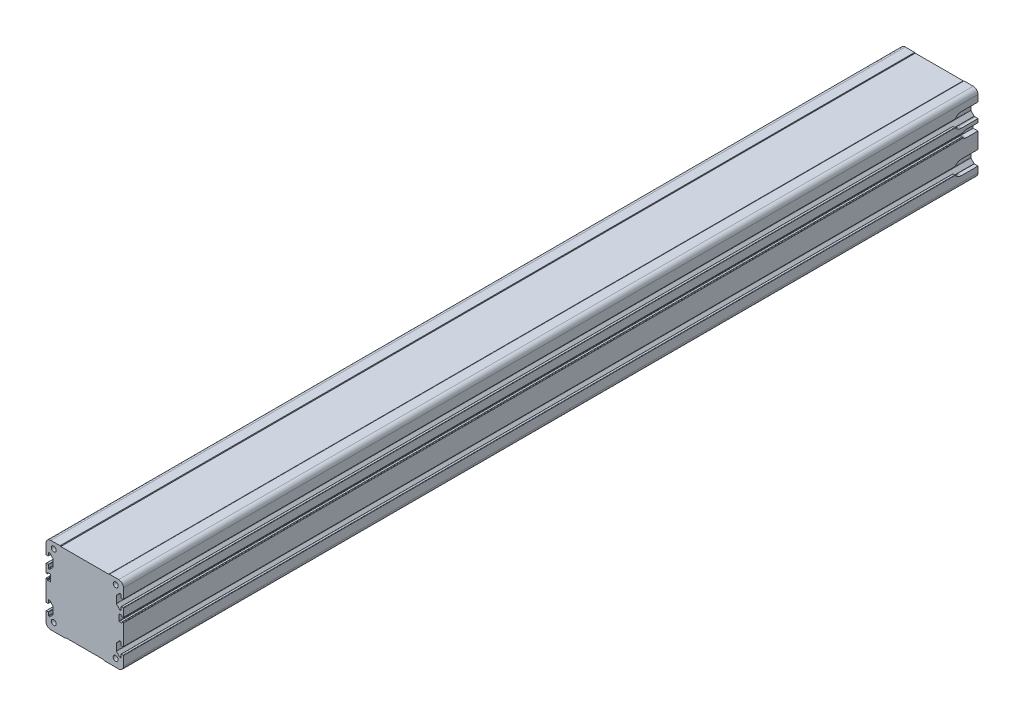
from build123d import *

# Parameters (mm, degrees)
EXTRUDE_1_DEPTH     = 717
CUT_EXTRUDE_1_DEPTH = 3
CUT_EXTRUDE_2_DEPTH = 4
HOLE_WIZARD_M5_1_D  = 4.2


with BuildPart() as part:
    # Sketch 1 → Extrude 1 (new body)
    with BuildSketch(Plane.XY):
        with BuildLine():
            Line((-20.255104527, 64.269974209), (-20.524892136, 64.430021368))
            ThreePointArc((-20.524892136, 64.430021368), (-20.647733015, 64.482185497), (-20.779996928, 64.499996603))
            Line((-20.779996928, 64.499996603), (-28.499994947, 64.500004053))
            ThreePointArc((-28.499994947, 64.500004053), (-31.328424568, 63.328432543), (-32.499998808, 60.500004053))
            Line((-32.499998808, 60.500004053), (-32.499998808, 52.299997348))
            ThreePointArc((-32.499998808, 52.299997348), (-32.412130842, 52.087865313), (-32.199998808, 51.999997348))
            Line((-32.199998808, 51.999997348), (-30.79999848, 51.999997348))
            ThreePointArc((-30.79999848, 51.999997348), (-30.587866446, 52.087865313), (-30.49999848, 52.299997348))
            Line((-30.49999848, 52.299997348), (-30.49999848, 54.700007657))
            ThreePointArc((-30.49999848, 54.700007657), (-30.412129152, 54.912141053), (-30.199994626, 55.000007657))
            Line((-30.199994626, 55.000007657), (-29.437900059, 54.999997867))
            ThreePointArc((-29.437900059, 54.999997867), (-29.318491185, 54.975207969), (-29.218815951, 54.904938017))
            Line((-29.218815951, 54.904938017), (-26.634851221, 52.142592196))
            ThreePointArc((-26.634851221, 52.142592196), (-26.534931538, 51.984637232), (-26.499997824, 51.801025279))
            Line((-26.499997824, 51.801025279), (-26.499997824, 46.198974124))
            ThreePointArc((-26.499997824, 46.198974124), (-26.534931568, 46.015362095), (-26.634851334, 45.857407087))
            Line((-26.634851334, 45.857407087), (-29.218823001, 43.095055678))
            ThreePointArc((-29.218823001, 43.095055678), (-29.318501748, 43.024784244), (-29.437914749, 42.9999959))
            Line((-29.437914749, 42.9999959), (-30.200002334, 43.00000569))
            ThreePointArc((-30.200002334, 43.00000569), (-30.412131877, 43.087875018), (-30.49999848, 43.30000569))
            Line((-30.49999848, 43.30000569), (-30.49999848, 45.700000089))
            ThreePointArc((-30.49999848, 45.700000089), (-30.587866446, 45.912132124), (-30.79999848, 46.000000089))
            Line((-30.79999848, 46.000000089), (-32.199998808, 46.000000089))
            ThreePointArc((-32.199998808, 46.000000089), (-32.412130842, 45.912132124), (-32.499998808, 45.700000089))
            Line((-32.499998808, 45.700000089), (-32.499998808, 39.043954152))
            ThreePointArc((-32.499998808, 39.043954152), (-32.412130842, 38.831822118), (-32.199998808, 38.743954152))
            Line((-32.199998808, 38.743954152), (-31.499997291, 38.743954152))
            ThreePointArc((-31.499997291, 38.743954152), (-31.287865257, 38.831822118), (-31.199997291, 39.043954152))
            Line((-31.199997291, 39.043954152), (-31.199997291, 39.543954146))
            ThreePointArc((-31.199997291, 39.543954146), (-31.112129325, 39.75608618), (-30.899997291, 39.843954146))
            Line((-30.899997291, 39.843954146), (-28.899997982, 39.843954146))
            ThreePointArc((-28.899997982, 39.843954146), (-28.687865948, 39.75608618), (-28.599997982, 39.543954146))
            Line((-28.599997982, 39.543954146), (-28.599997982, 34.443954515))
            ThreePointArc((-28.599997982, 34.443954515), (-28.687865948, 34.231822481), (-28.899997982, 34.143954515))
            Line((-28.899997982, 34.143954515), (-30.899997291, 34.143954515))
            ThreePointArc((-30.899997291, 34.143954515), (-31.112129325, 34.231822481), (-31.199997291, 34.443954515))
            Line((-31.199997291, 34.443954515), (-31.199997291, 34.943954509))
            ThreePointArc((-31.199997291, 34.943954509), (-31.287865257, 35.156086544), (-31.499997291, 35.243954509))
            Line((-31.499997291, 35.243954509), (-32.199998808, 35.243954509))
            ThreePointArc((-32.199998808, 35.243954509), (-32.412130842, 35.156086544), (-32.499998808, 34.94395451))
            Line((-32.499998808, 34.94395451), (-32.499998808, 17.800000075))
            ThreePointArc((-32.499998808, 17.800000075), (-32.412130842, 17.58786804), (-32.199998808, 17.500000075))
            Line((-32.199998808, 17.500000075), (-30.800000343, 17.500000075))
            ThreePointArc((-30.800000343, 17.500000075), (-30.587868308, 17.58786804), (-30.500000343, 17.800000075))
            Line((-30.500000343, 17.800000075), (-30.500000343, 20.199998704))
            ThreePointArc((-30.500000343, 20.199998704), (-30.412132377, 20.412130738), (-30.200000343, 20.499998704))
            Line((-30.200000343, 20.499998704), (-29.437907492, 20.499998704))
            ThreePointArc((-29.437907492, 20.499998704), (-29.318496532, 20.475209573), (-29.218819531, 20.404938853))
            Line((-29.218819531, 20.404938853), (-26.634853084, 17.642591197))
            ThreePointArc((-26.634853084, 17.642591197), (-26.534933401, 17.484636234), (-26.499999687, 17.301024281))
            Line((-26.499999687, 17.301024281), (-26.499999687, 11.698975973))
            ThreePointArc((-26.499999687, 11.698975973), (-26.534933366, 11.515364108), (-26.634852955, 11.357409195))
            Line((-26.634852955, 11.357409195), (-29.218819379, 8.595059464))
            ThreePointArc((-29.218819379, 8.595059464), (-29.318496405, 8.524788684), (-29.437907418, 8.499999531))
            Line((-29.437907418, 8.499999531), (-30.200000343, 8.499999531))
            ThreePointArc((-30.200000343, 8.499999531), (-30.412132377, 8.587867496), (-30.500000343, 8.799999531))
            Line((-30.500000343, 8.799999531), (-30.500000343, 11.200000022))
            ThreePointArc((-30.500000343, 11.200000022), (-30.587868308, 11.412132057), (-30.800000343, 11.500000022))
            Line((-30.800000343, 11.500000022), (-32.199998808, 11.500000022))
            ThreePointArc((-32.199998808, 11.500000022), (-32.412130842, 11.412132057), (-32.499998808, 11.200000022))
            Line((-32.499998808, 11.200000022), (-32.499998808, 3.500000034))
            ThreePointArc((-32.499998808, 3.500000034), (-31.328425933, 0.67157291), (-28.499998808, -0.499999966))
            Line((-28.499998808, -0.499999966), (-16.482218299, -0.499999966))
            ThreePointArc((-16.482218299, -0.499999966), (-16.255782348, -0.474026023), (-16.041109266, -0.397453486))
            Line((-16.041109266, -0.397453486), (-15.441109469, -0.10254648))
            ThreePointArc((-15.441109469, -0.10254648), (-15.226436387, -0.025973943), (-15.000000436, 0))
            Line((-15.000000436, 0), (15.000000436, 0))
            ThreePointArc((15.000000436, 0), (15.226436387, -0.025973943), (15.441109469, -0.10254648))
            Line((15.441109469, -0.10254648), (16.041109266, -0.397453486))
            ThreePointArc((16.041109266, -0.397453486), (16.255782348, -0.474026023), (16.482218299, -0.499999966))
            Line((16.482218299, -0.499999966), (28.499998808, -0.499999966))
            ThreePointArc((28.499998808, -0.499999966), (31.328425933, 0.67157291), (32.499998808, 3.500000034))
            Line((32.499998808, 3.500000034), (32.499998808, 11.200000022))
            ThreePointArc((32.499998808, 11.200000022), (32.412130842, 11.412132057), (32.199998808, 11.500000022))
            Line((32.199998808, 11.500000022), (30.800000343, 11.500000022))
            ThreePointArc((30.800000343, 11.500000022), (30.587868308, 11.412132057), (30.500000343, 11.200000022))
            Line((30.500000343, 11.200000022), (30.500000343, 8.799999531))
            ThreePointArc((30.500000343, 8.799999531), (30.412132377, 8.587867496), (30.200000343, 8.499999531))
            Line((30.200000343, 8.499999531), (29.437907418, 8.499999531))
            ThreePointArc((29.437907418, 8.499999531), (29.318496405, 8.524788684), (29.218819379, 8.595059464))
            Line((29.218819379, 8.595059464), (26.634852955, 11.357409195))
            ThreePointArc((26.634852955, 11.357409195), (26.534933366, 11.515364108), (26.499999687, 11.698975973))
            Line((26.499999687, 11.698975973), (26.499999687, 17.301024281))
            ThreePointArc((26.499999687, 17.301024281), (26.534933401, 17.484636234), (26.634853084, 17.642591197))
            Line((26.634853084, 17.642591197), (29.218819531, 20.404938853))
            ThreePointArc((29.218819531, 20.404938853), (29.318496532, 20.475209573), (29.437907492, 20.499998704))
            Line((29.437907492, 20.499998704), (30.200000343, 20.499998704))
            ThreePointArc((30.200000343, 20.499998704), (30.412132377, 20.412130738), (30.500000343, 20.199998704))
            Line((30.500000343, 20.199998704), (30.500000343, 17.800000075))
            ThreePointArc((30.500000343, 17.800000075), (30.587868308, 17.58786804), (30.800000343, 17.500000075))
            Line((30.800000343, 17.500000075), (32.199998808, 17.500000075))
            ThreePointArc((32.199998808, 17.500000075), (32.412130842, 17.58786804), (32.499998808, 17.800000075))
            Line((32.499998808, 17.800000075), (32.499998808, 34.943954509))
            ThreePointArc((32.499998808, 34.943954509), (32.412130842, 35.156086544), (32.199998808, 35.243954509))
            Line((32.199998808, 35.243954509), (31.499997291, 35.243954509))
            ThreePointArc((31.499997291, 35.243954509), (31.287865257, 35.156086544), (31.199997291, 34.94395451))
            Line((31.199997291, 34.94395451), (31.199997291, 34.443954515))
            ThreePointArc((31.199997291, 34.443954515), (31.112129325, 34.231822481), (30.899997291, 34.143954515))
            Line((30.899997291, 34.143954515), (28.899997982, 34.143954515))
            ThreePointArc((28.899997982, 34.143954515), (28.687865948, 34.231822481), (28.599997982, 34.443954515))
            Line((28.599997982, 34.443954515), (28.599997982, 39.543954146))
            ThreePointArc((28.599997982, 39.543954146), (28.687865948, 39.75608618), (28.899997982, 39.843954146))
            Line((28.899997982, 39.843954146), (30.899997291, 39.843954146))
            ThreePointArc((30.899997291, 39.843954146), (31.112129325, 39.75608618), (31.199997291, 39.543954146))
            Line((31.199997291, 39.543954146), (31.199997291, 39.043954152))
            ThreePointArc((31.199997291, 39.043954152), (31.287865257, 38.831822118), (31.499997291, 38.743954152))
            Line((31.499997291, 38.743954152), (32.199998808, 38.743954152))
            ThreePointArc((32.199998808, 38.743954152), (32.412130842, 38.831822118), (32.499998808, 39.043954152))
            Line((32.499998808, 39.043954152), (32.499998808, 45.700000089))
            ThreePointArc((32.499998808, 45.700000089), (32.412130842, 45.912132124), (32.199998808, 46.000000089))
            Line((32.199998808, 46.000000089), (30.79999848, 46.000000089))
            ThreePointArc((30.79999848, 46.000000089), (30.587866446, 45.912132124), (30.49999848, 45.700000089))
            Line((30.49999848, 45.700000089), (30.49999848, 43.30000569))
            ThreePointArc((30.49999848, 43.30000569), (30.412131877, 43.087875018), (30.200002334, 43.00000569))
            Line((30.200002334, 43.00000569), (29.437914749, 42.9999959))
            ThreePointArc((29.437914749, 42.9999959), (29.318501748, 43.024784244), (29.218823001, 43.095055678))
            Line((29.218823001, 43.095055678), (26.634851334, 45.857407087))
            ThreePointArc((26.634851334, 45.857407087), (26.534931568, 46.015362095), (26.499997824, 46.198974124))
            Line((26.499997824, 46.198974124), (26.499997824, 51.801025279))
            ThreePointArc((26.499997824, 51.801025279), (26.534931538, 51.984637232), (26.634851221, 52.142592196))
            Line((26.634851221, 52.142592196), (29.218815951, 54.904938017))
            ThreePointArc((29.218815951, 54.904938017), (29.318491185, 54.975207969), (29.437900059, 54.999997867))
            Line((29.437900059, 54.999997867), (30.199994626, 55.000007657))
            ThreePointArc((30.199994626, 55.000007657), (30.412129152, 54.912141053), (30.49999848, 54.700007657))
            Line((30.49999848, 54.700007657), (30.49999848, 52.299997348))
            ThreePointArc((30.49999848, 52.299997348), (30.587866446, 52.087865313), (30.79999848, 51.999997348))
            Line((30.79999848, 51.999997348), (32.199998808, 51.999997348))
            ThreePointArc((32.199998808, 51.999997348), (32.412130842, 52.087865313), (32.499998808, 52.299997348))
            Line((32.499998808, 52.299997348), (32.499998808, 60.500004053))
            ThreePointArc((32.499998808, 60.500004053), (31.328424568, 63.328432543), (28.499994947, 64.500004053))
            Line((28.499994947, 64.500004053), (20.779996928, 64.499996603))
            ThreePointArc((20.779996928, 64.499996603), (20.647733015, 64.482185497), (20.524892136, 64.430021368))
            Line((20.524892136, 64.430021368), (20.255104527, 64.269974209))
            ThreePointArc((20.255104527, 64.269974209), (20.132263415, 64.217810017), (19.999999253, 64.199998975))
            Line((19.999999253, 64.199998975), (-19.999999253, 64.199998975))
            ThreePointArc((-19.999999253, 64.199998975), (-20.132263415, 64.217810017), (-20.255104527, 64.269974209))
        make_face()
    extrude(amount=EXTRUDE_1_DEPTH)

    # Sketch 2 → Cut-Extrude 1 (cut)
    with BuildSketch(Plane.ZY.offset(32.499998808)):
        with BuildLine():
            Line((0, 54.999999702), (14, 54.999999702))
            ThreePointArc((14, 54.999999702), (20, 48.999999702), (14, 42.999999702))
            Line((14, 42.999999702), (0, 42.999999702))
            ThreePointArc((0, 42.999999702), (-6, 48.999999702), (0, 54.999999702))
        make_face()
        with BuildLine():
            Line((0, 20.500000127), (14, 20.500000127))
            ThreePointArc((14, 20.500000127), (20, 14.500000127), (14, 8.500000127))
            Line((14, 8.500000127), (0, 8.500000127))
            ThreePointArc((0, 8.500000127), (-6, 14.500000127), (0, 20.500000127))
        make_face()
    cut_extrude_1 = extrude(amount=-CUT_EXTRUDE_1_DEPTH, mode=Mode.SUBTRACT)

    # Sketch 3 → Cut-Extrude 2 (cut)
    with BuildSketch(Plane.ZY.offset(32.499998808)):
        with BuildLine():
            Line((0, 39.993954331), (10, 39.993954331))
            ThreePointArc((10, 39.993954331), (13, 36.993954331), (10, 33.993954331))
            Line((10, 33.993954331), (0, 33.993954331))
            ThreePointArc((0, 33.993954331), (-3, 36.993954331), (0, 39.993954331))
        make_face()
    cut_extrude_2 = extrude(amount=-CUT_EXTRUDE_2_DEPTH, mode=Mode.SUBTRACT)

    # Mirror 1: Cut-Extrude 1, Cut-Extrude 2 across plane
    add(cut_extrude_1.mirror(Plane(origin=(0, 0, 0), x_dir=(0, 0, 1), z_dir=(1, 0, 0))), mode=Mode.SUBTRACT)
    add(cut_extrude_2.mirror(Plane(origin=(0, 0, 0), x_dir=(0, 0, 1), z_dir=(1, 0, 0))), mode=Mode.SUBTRACT)

    # Hole Wizard M5 _1 (through all)
    with Locations(Plane.XY.offset(717)):
        with Locations((-26, 59.50000164), (-26, 6.000000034), (26, 6.000000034), (26, 59.50000164)):
            Hole(HOLE_WIZARD_M5_1_D / 2)


solid = part.part
